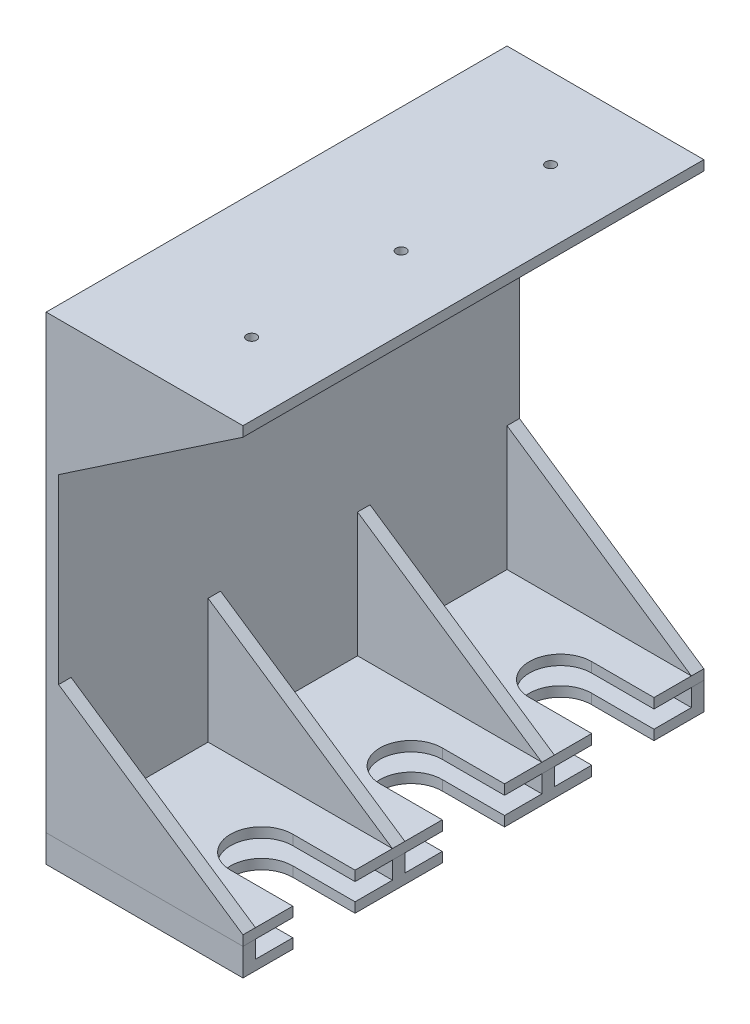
from build123d import *

# Parameters (mm, degrees)
EXTRUDE_3_DEPTH     = 4
EXTRUDE_4_DEPTH     = 4
EXTRUDE_5_DEPTH     = 7
SKETCH_5_W          = 5
SKETCH_5_H          = 184.997042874
EXTRUDE_6_DEPTH     = 173
EXTRUDE_7_DEPTH     = 5
EXTRUDE_8_DEPTH     = 5
EXTRUDE_9_DEPTH     = 5
EXTRUDE_10_DEPTH    = 5
SKETCH_10_W         = 78.998737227
SKETCH_10_H         = 184.997042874
EXTRUDE_11_DEPTH    = 4
SKETCH_11_R         = 2
CUT_EXTRUDE_1_DEPTH = 4


with BuildPart() as part:
    # Sketch 2 → Extrude 3 (new body)
    with BuildSketch(Plane(origin=(0, 0, 0), x_dir=(1, 0, 0), z_dir=(0, 1, 0))):
        with BuildLine():
            Line((-1.691442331, 66.187038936), (-1.691442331, -118.810003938))
            Line((-1.691442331, -118.810003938), (77.307294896, -118.810003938))
            Line((77.307294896, -118.810003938), (77.307294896, -98.810215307))
            Line((77.307294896, -98.810215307), (52.307694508, -98.810215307))
            ThreePointArc((52.307694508, -98.810215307), (39.808002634, -86.310523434), (52.307694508, -73.81083156))
            Line((52.307694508, -73.81083156), (77.307294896, -73.81083156))
            Line((77.307294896, -73.81083156), (77.307294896, -38.811282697))
            Line((77.307294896, -38.811282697), (52.307654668, -38.811282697))
            ThreePointArc((52.307654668, -38.811282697), (39.808002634, -26.311630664), (52.307654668, -13.81197863))
            Line((52.307654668, -13.81197863), (77.307294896, -13.81197863))
            Line((77.307294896, -13.81197863), (77.307294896, 21.187678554))
            Line((77.307294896, 21.187678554), (52.276134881, 21.187678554))
            ThreePointArc((52.276134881, 21.187678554), (39.776294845, 33.68751859), (52.276134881, 46.187358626))
            Line((52.276134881, 46.187358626), (77.307294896, 46.187358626))
            Line((77.307294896, 46.187358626), (77.307294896, 66.187038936))
            Line((77.307294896, 66.187038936), (-1.691442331, 66.187038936))
        make_face()
    extrude(amount=EXTRUDE_3_DEPTH)

    # Sketch 4 → Extrude 5 (add)
    with BuildSketch(Plane(origin=(0, 4, 0), x_dir=(1, 0, 0), z_dir=(0, 1, 0))):
        Polygon((2.308557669, -113.810003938), (77.307294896, -113.810003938), (77.307294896, -118.810003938), (-1.691442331, -118.810003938), (-1.691442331, 66.187038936), (77.307294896, 66.187038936), (77.307294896, 61.187038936), (2.308557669, 61.187038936), (2.308557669, 6.189996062), (77.307294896, 6.189996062), (77.307294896, 1.189996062), (2.308557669, 1.189996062), (2.308557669, -53.810003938), (77.307294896, -53.810003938), (77.307294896, -58.810003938), (2.308557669, -58.810003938), align=None)
    extrude(amount=EXTRUDE_5_DEPTH)


with BuildPart() as body_2:
    # Sketch 3 → Extrude 4 (new body)
    with BuildSketch(Plane(origin=(0, 11, 0), x_dir=(1, 0, 0), z_dir=(0, 1, 0))):
        with BuildLine():
            Line((-1.691442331, 66.187038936), (-1.691442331, -118.810003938))
            Line((-1.691442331, -118.810003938), (77.307294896, -118.810003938))
            Line((77.307294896, -118.810003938), (77.307294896, -98.810215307))
            Line((77.307294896, -98.810215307), (52.307694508, -98.810215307))
            ThreePointArc((52.307694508, -98.810215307), (39.808002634, -86.310523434), (52.307694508, -73.81083156))
            Line((52.307694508, -73.81083156), (77.307294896, -73.81083156))
            Line((77.307294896, -73.81083156), (77.307294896, -38.811282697))
            Line((77.307294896, -38.811282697), (52.307654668, -38.811282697))
            ThreePointArc((52.307654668, -38.811282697), (39.808002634, -26.311630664), (52.307654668, -13.81197863))
            Line((52.307654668, -13.81197863), (77.307294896, -13.81197863))
            Line((77.307294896, -13.81197863), (77.307294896, 21.187678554))
            Line((77.307294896, 21.187678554), (52.276134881, 21.187678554))
            ThreePointArc((52.276134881, 21.187678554), (39.776294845, 33.68751859), (52.276134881, 46.187358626))
            Line((52.276134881, 46.187358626), (77.307294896, 46.187358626))
            Line((77.307294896, 46.187358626), (77.307294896, 66.187038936))
            Line((77.307294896, 66.187038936), (-1.691442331, 66.187038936))
        make_face()
    extrude(amount=EXTRUDE_4_DEPTH)

    # Sketch 5 → Extrude 6 (add)
    with BuildSketch(Plane(origin=(0, 15, 0), x_dir=(1, 0, 0), z_dir=(0, 1, 0))):
        with Locations((0.808557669, -26.311482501)):
            Rectangle(SKETCH_5_W, SKETCH_5_H)
    extrude(amount=EXTRUDE_6_DEPTH)

    # Sketch 6 → Extrude 7 (add)
    with BuildSketch(Plane.XY.offset(118.810003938)):
        Polygon((3.308557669, 65), (3.308557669, 15), (77.307294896, 15), align=None)
        Polygon((3.308557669, 188), (77.307294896, 188), (3.308557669, 138), align=None)
    extrude(amount=-EXTRUDE_7_DEPTH)

    # Sketch 7 → Extrude 8 (add)
    with BuildSketch(Plane.XY.offset(58.810003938)):
        Polygon((3.308557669, 65), (77.307294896, 15), (3.308557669, 15), align=None)
    extrude(amount=-EXTRUDE_8_DEPTH)

    # Sketch 8 → Extrude 9 (add)
    with BuildSketch(Plane.XY.offset(-1.189996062)):
        Polygon((3.308557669, 65), (77.307294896, 15), (3.308557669, 15), align=None)
    extrude(amount=-EXTRUDE_9_DEPTH)

    # Sketch 9 → Extrude 10 (add)
    with BuildSketch(Plane.XY.offset(-61.189996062)):
        Polygon((3.308557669, 138), (77.307294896, 188), (3.308557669, 188), align=None)
        Polygon((3.308557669, 65), (77.307294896, 15), (3.308557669, 15), align=None)
    extrude(amount=-EXTRUDE_10_DEPTH)

    # Sketch 10 → Extrude 11 (add)
    with BuildSketch(Plane(origin=(0, 188, 0), x_dir=(1, 0, 0), z_dir=(0, 1, 0))):
        with Locations((37.807926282, -26.311482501)):
            Rectangle(SKETCH_10_W, SKETCH_10_H)
    extrude(amount=EXTRUDE_11_DEPTH)

    # Sketch 11 → Cut-Extrude 1 (cut)
    with BuildSketch(Plane(origin=(0, 192, 0), x_dir=(1, 0, 0), z_dir=(0, 1, 0))):
        with Locations(Location((48.308557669, 33.689996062, 0), (0, 0, 270))):
            Circle(SKETCH_11_R)
        with Locations(Location((48.308557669, -26.310003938, 0), (0, 0, 270))):
            Circle(SKETCH_11_R)
        with Locations(Location((48.308557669, -86.310003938, 0), (0, 0, 270))):
            Circle(SKETCH_11_R)
    extrude(amount=-CUT_EXTRUDE_1_DEPTH, mode=Mode.SUBTRACT)


solid = Compound([part.part, body_2.part])
